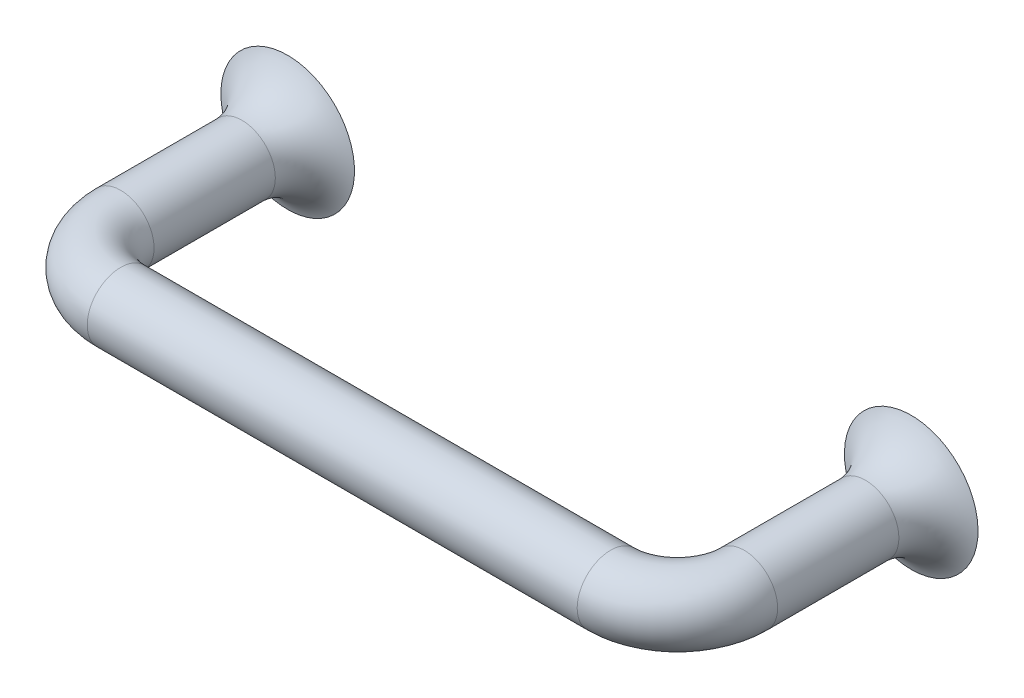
ISO-10303-21;
HEADER;
FILE_DESCRIPTION(('STEP AP214'),'2;1');
FILE_NAME('part.step','',(''),(''),'','','');
FILE_SCHEMA(('AUTOMOTIVE_DESIGN { 1 0 10303 214 1 1 1 1 }'));
ENDSEC;
DATA;
#1=APPLICATION_CONTEXT('core data for automotive mechanical design processes');
#2=APPLICATION_PROTOCOL_DEFINITION('international standard','automotive_design',2000,#1);
#3=PRODUCT_CONTEXT('',#1,'mechanical');
#4=PRODUCT('Part','Part','',(#3));
#5=PRODUCT_RELATED_PRODUCT_CATEGORY('part','',(#4));
#6=PRODUCT_DEFINITION_FORMATION('','',#4);
#7=PRODUCT_DEFINITION_CONTEXT('part definition',#1,'design');
#8=PRODUCT_DEFINITION('design','',#6,#7);
#9=PRODUCT_DEFINITION_SHAPE('','',#8);
#10=(LENGTH_UNIT() NAMED_UNIT(*) SI_UNIT(.MILLI.,.METRE.));
#11=(NAMED_UNIT(*) PLANE_ANGLE_UNIT() SI_UNIT($,.RADIAN.));
#12=(NAMED_UNIT(*) SI_UNIT($,.STERADIAN.) SOLID_ANGLE_UNIT());
#13=UNCERTAINTY_MEASURE_WITH_UNIT(LENGTH_MEASURE(1.E-05),#10,'distance_accuracy_value','');
#14=(GEOMETRIC_REPRESENTATION_CONTEXT(3) GLOBAL_UNCERTAINTY_ASSIGNED_CONTEXT((#13)) GLOBAL_UNIT_ASSIGNED_CONTEXT((#10,
#11,#12)) REPRESENTATION_CONTEXT('',''));
#15=CARTESIAN_POINT('',(0.,0.,0.));
#16=DIRECTION('',(0.,0.,1.));
#17=DIRECTION('',(1.,0.,0.));
#18=AXIS2_PLACEMENT_3D('',#15,#16,#17);
#19=CARTESIAN_POINT('',(0.,0.,37.5000000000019));
#20=DIRECTION('',(0.,0.,-1.));
#21=DIRECTION('',(0.,-1.,0.));
#22=AXIS2_PLACEMENT_3D('',#19,#20,#21);
#23=CYLINDRICAL_SURFACE('',#22,7.5);
#24=CARTESIAN_POINT('',(0.,0.,10.2736435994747));
#25=DIRECTION('',(0.,0.,1.));
#26=DIRECTION('',(1.,0.,0.));
#27=AXIS2_PLACEMENT_3D('',#24,#25,#26);
#28=CIRCLE('',#27,7.5);
#29=CARTESIAN_POINT('',(7.5,0.,10.2736435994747));
#30=VERTEX_POINT('',#29);
#31=EDGE_CURVE('E32',#30,#30,#28,.F.);
#32=ORIENTED_EDGE('',*,*,#31,.F.);
#33=EDGE_LOOP('',(#32));
#34=FACE_BOUND('',#33,.T.);
#35=CARTESIAN_POINT('',(0.,0.,37.5000000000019));
#36=DIRECTION('',(0.,0.,-1.));
#37=DIRECTION('',(0.,1.,0.));
#38=AXIS2_PLACEMENT_3D('',#35,#36,#37);
#39=CIRCLE('',#38,7.5);
#40=CARTESIAN_POINT('',(-7.5,0.,37.5000000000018));
#41=VERTEX_POINT('',#40);
#42=EDGE_CURVE('E35',#41,#41,#39,.T.);
#43=ORIENTED_EDGE('',*,*,#42,.T.);
#44=EDGE_LOOP('',(#43));
#45=FACE_BOUND('',#44,.T.);
#46=ADVANCED_FACE('F12',(#34,#45),#23,.T.);
#47=CARTESIAN_POINT('',(15.,0.,37.5000000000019));
#48=DIRECTION('',(0.,-1.,0.));
#49=DIRECTION('',(1.,0.,0.));
#50=AXIS2_PLACEMENT_3D('',#47,#48,#49);
#51=TOROIDAL_SURFACE('',#50,15.,7.5);
#52=CARTESIAN_POINT('',(15.,0.,52.5000000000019));
#53=DIRECTION('',(-1.,0.,0.));
#54=DIRECTION('',(0.,1.,0.));
#55=AXIS2_PLACEMENT_3D('',#52,#53,#54);
#56=CIRCLE('',#55,7.5);
#57=CARTESIAN_POINT('',(15.,0.,60.0000000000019));
#58=VERTEX_POINT('',#57);
#59=EDGE_CURVE('E43',#58,#58,#56,.T.);
#60=CARTESIAN_POINT('',(15.,0.,37.5000000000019));
#61=DIRECTION('',(0.,-1.,0.));
#62=DIRECTION('',(1.,0.,0.));
#63=AXIS2_PLACEMENT_3D('',#60,#61,#62);
#64=CIRCLE('',#63,22.5);
#65=EDGE_CURVE('',#58,#41,#64,.T.);
#66=ORIENTED_EDGE('',*,*,#59,.T.);
#67=ORIENTED_EDGE('',*,*,#42,.F.);
#68=ORIENTED_EDGE('',*,*,#65,.T.);
#69=ORIENTED_EDGE('',*,*,#65,.F.);
#70=EDGE_LOOP('',(#66,#68,#67,#69));
#71=FACE_BOUND('',#70,.T.);
#72=ADVANCED_FACE('F81',(#71),#51,.T.);
#73=CARTESIAN_POINT('',(125.,0.,52.5000000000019));
#74=DIRECTION('',(-1.,0.,0.));
#75=DIRECTION('',(0.,-1.,0.));
#76=AXIS2_PLACEMENT_3D('',#73,#74,#75);
#77=CYLINDRICAL_SURFACE('',#76,7.5);
#78=CARTESIAN_POINT('',(125.,0.,52.5000000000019));
#79=DIRECTION('',(-1.,0.,0.));
#80=DIRECTION('',(0.,1.,0.));
#81=AXIS2_PLACEMENT_3D('',#78,#79,#80);
#82=CIRCLE('',#81,7.5);
#83=CARTESIAN_POINT('',(125.,0.,60.0000000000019));
#84=VERTEX_POINT('',#83);
#85=EDGE_CURVE('E46',#84,#84,#82,.T.);
#86=ORIENTED_EDGE('',*,*,#85,.T.);
#87=EDGE_LOOP('',(#86));
#88=FACE_BOUND('',#87,.T.);
#89=ORIENTED_EDGE('',*,*,#59,.F.);
#90=EDGE_LOOP('',(#89));
#91=FACE_BOUND('',#90,.T.);
#92=ADVANCED_FACE('F88',(#88,#91),#77,.T.);
#93=CARTESIAN_POINT('',(125.,0.,37.5000000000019));
#94=DIRECTION('',(0.,-1.,0.));
#95=DIRECTION('',(1.,0.,0.));
#96=AXIS2_PLACEMENT_3D('',#93,#94,#95);
#97=TOROIDAL_SURFACE('',#96,15.,7.5);
#98=CARTESIAN_POINT('',(140.,0.,37.5000000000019));
#99=DIRECTION('',(0.,0.,1.));
#100=DIRECTION('',(0.,1.,0.));
#101=AXIS2_PLACEMENT_3D('',#98,#99,#100);
#102=CIRCLE('',#101,7.5);
#103=CARTESIAN_POINT('',(147.5,0.,37.5000000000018));
#104=VERTEX_POINT('',#103);
#105=EDGE_CURVE('E39',#104,#104,#102,.T.);
#106=CARTESIAN_POINT('',(125.,0.,37.5000000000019));
#107=DIRECTION('',(0.,-1.,0.));
#108=DIRECTION('',(1.,0.,0.));
#109=AXIS2_PLACEMENT_3D('',#106,#107,#108);
#110=CIRCLE('',#109,22.5);
#111=EDGE_CURVE('',#104,#84,#110,.T.);
#112=ORIENTED_EDGE('',*,*,#105,.T.);
#113=ORIENTED_EDGE('',*,*,#85,.F.);
#114=ORIENTED_EDGE('',*,*,#111,.T.);
#115=ORIENTED_EDGE('',*,*,#111,.F.);
#116=EDGE_LOOP('',(#112,#114,#113,#115));
#117=FACE_BOUND('',#116,.T.);
#118=ADVANCED_FACE('F131',(#117),#97,.T.);
#119=CARTESIAN_POINT('',(140.,0.,37.5000000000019));
#120=DIRECTION('',(0.,0.,-1.));
#121=DIRECTION('',(0.,-1.,0.));
#122=AXIS2_PLACEMENT_3D('',#119,#120,#121);
#123=CYLINDRICAL_SURFACE('',#122,7.5);
#124=CARTESIAN_POINT('',(140.,0.,10.2736435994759));
#125=DIRECTION('',(0.,0.,1.));
#126=DIRECTION('',(0.,1.,0.));
#127=AXIS2_PLACEMENT_3D('',#124,#125,#126);
#128=CIRCLE('',#127,7.5);
#129=CARTESIAN_POINT('',(140.,7.5,10.2736435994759));
#130=VERTEX_POINT('',#129);
#131=EDGE_CURVE('E36',#130,#130,#128,.T.);
#132=ORIENTED_EDGE('',*,*,#131,.T.);
#133=EDGE_LOOP('',(#132));
#134=FACE_BOUND('',#133,.T.);
#135=ORIENTED_EDGE('',*,*,#105,.F.);
#136=EDGE_LOOP('',(#135));
#137=FACE_BOUND('',#136,.T.);
#138=ADVANCED_FACE('F124',(#134,#137),#123,.T.);
#139=CARTESIAN_POINT('',(140.,0.,11.1368217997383));
#140=DIRECTION('',(0.,0.,-1.));
#141=DIRECTION('',(0.,-1.,0.));
#142=AXIS2_PLACEMENT_3D('',#139,#140,#141);
#143=TOROIDAL_SURFACE('',#142,19.4689148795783,12.);
#144=CARTESIAN_POINT('',(140.,0.,1.93598338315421E-12));
#145=DIRECTION('',(0.,0.,-1.));
#146=DIRECTION('',(0.,-1.,0.));
#147=AXIS2_PLACEMENT_3D('',#144,#145,#146);
#148=CIRCLE('',#147,15.);
#149=CARTESIAN_POINT('',(140.,-15.,1.93598338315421E-12));
#150=VERTEX_POINT('',#149);
#151=EDGE_CURVE('E40',#150,#150,#148,.T.);
#152=ORIENTED_EDGE('',*,*,#151,.F.);
#153=EDGE_LOOP('',(#152));
#154=FACE_BOUND('',#153,.T.);
#155=ORIENTED_EDGE('',*,*,#131,.F.);
#156=EDGE_LOOP('',(#155));
#157=FACE_BOUND('',#156,.T.);
#158=ADVANCED_FACE('F121',(#154,#157),#143,.F.);
#159=CARTESIAN_POINT('',(140.,0.,1.93598338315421E-12));
#160=DIRECTION('',(0.,0.,1.));
#161=DIRECTION('',(0.,1.,0.));
#162=AXIS2_PLACEMENT_3D('',#159,#160,#161);
#163=PLANE('',#162);
#164=CARTESIAN_POINT('',(140.,0.,1.93598338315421E-12));
#165=DIRECTION('',(0.,0.,1.));
#166=DIRECTION('',(1.,0.,0.));
#167=AXIS2_PLACEMENT_3D('',#164,#165,#166);
#168=CIRCLE('',#167,3.45);
#169=CARTESIAN_POINT('',(143.45,0.,1.93598338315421E-12));
#170=VERTEX_POINT('',#169);
#171=EDGE_CURVE('E23',#170,#170,#168,.T.);
#172=ORIENTED_EDGE('',*,*,#171,.T.);
#173=EDGE_LOOP('',(#172));
#174=FACE_BOUND('',#173,.T.);
#175=ORIENTED_EDGE('',*,*,#151,.T.);
#176=EDGE_LOOP('',(#175));
#177=FACE_BOUND('',#176,.T.);
#178=ADVANCED_FACE('F119',(#174,#177),#163,.F.);
#179=CARTESIAN_POINT('',(0.,0.,11.1368217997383));
#180=DIRECTION('',(0.,0.,-1.));
#181=DIRECTION('',(-1.,0.,0.));
#182=AXIS2_PLACEMENT_3D('',#179,#180,#181);
#183=TOROIDAL_SURFACE('',#182,19.4689148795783,12.);
#184=ORIENTED_EDGE('',*,*,#31,.T.);
#185=EDGE_LOOP('',(#184));
#186=FACE_BOUND('',#185,.T.);
#187=CARTESIAN_POINT('',(0.,0.,1.91233057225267E-12));
#188=DIRECTION('',(0.,0.,-1.));
#189=DIRECTION('',(-1.,0.,0.));
#190=AXIS2_PLACEMENT_3D('',#187,#188,#189);
#191=CIRCLE('',#190,15.);
#192=CARTESIAN_POINT('',(-15.,0.,1.9359833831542E-12));
#193=VERTEX_POINT('',#192);
#194=EDGE_CURVE('E53',#193,#193,#191,.T.);
#195=ORIENTED_EDGE('',*,*,#194,.F.);
#196=EDGE_LOOP('',(#195));
#197=FACE_BOUND('',#196,.T.);
#198=ADVANCED_FACE('F114',(#186,#197),#183,.F.);
#199=CARTESIAN_POINT('',(0.,0.,1.94986117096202E-12));
#200=DIRECTION('',(0.,0.,-1.));
#201=DIRECTION('',(0.,1.,0.));
#202=AXIS2_PLACEMENT_3D('',#199,#200,#201);
#203=PLANE('',#202);
#204=CARTESIAN_POINT('',(0.,0.,1.94986117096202E-12));
#205=DIRECTION('',(0.,0.,-1.));
#206=DIRECTION('',(-1.,0.,0.));
#207=AXIS2_PLACEMENT_3D('',#204,#205,#206);
#208=CIRCLE('',#207,3.45);
#209=CARTESIAN_POINT('',(-3.45,0.,1.85376087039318E-12));
#210=VERTEX_POINT('',#209);
#211=EDGE_CURVE('E8',#210,#210,#208,.F.);
#212=ORIENTED_EDGE('',*,*,#211,.T.);
#213=EDGE_LOOP('',(#212));
#214=FACE_BOUND('',#213,.T.);
#215=ORIENTED_EDGE('',*,*,#194,.T.);
#216=EDGE_LOOP('',(#215));
#217=FACE_BOUND('',#216,.T.);
#218=ADVANCED_FACE('F107',(#214,#217),#203,.T.);
#219=CARTESIAN_POINT('',(140.,0.,12.0000000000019));
#220=DIRECTION('',(0.,0.,-1.));
#221=DIRECTION('',(0.,-1.,0.));
#222=AXIS2_PLACEMENT_3D('',#219,#220,#221);
#223=CYLINDRICAL_SURFACE('',#222,3.);
#224=CARTESIAN_POINT('',(140.,0.,0.450000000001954));
#225=DIRECTION('',(0.,0.,1.));
#226=DIRECTION('',(1.,0.,0.));
#227=AXIS2_PLACEMENT_3D('',#224,#225,#226);
#228=CIRCLE('',#227,3.);
#229=CARTESIAN_POINT('',(143.,0.,0.450000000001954));
#230=VERTEX_POINT('',#229);
#231=EDGE_CURVE('E27',#230,#230,#228,.F.);
#232=ORIENTED_EDGE('',*,*,#231,.T.);
#233=EDGE_LOOP('',(#232));
#234=FACE_BOUND('',#233,.T.);
#235=CARTESIAN_POINT('',(140.,0.,12.0000000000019));
#236=DIRECTION('',(0.,0.,-1.));
#237=DIRECTION('',(0.,-1.,0.));
#238=AXIS2_PLACEMENT_3D('',#235,#236,#237);
#239=CIRCLE('',#238,3.);
#240=CARTESIAN_POINT('',(140.,-3.,12.0000000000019));
#241=VERTEX_POINT('',#240);
#242=EDGE_CURVE('E56',#241,#241,#239,.T.);
#243=ORIENTED_EDGE('',*,*,#242,.F.);
#244=EDGE_LOOP('',(#243));
#245=FACE_BOUND('',#244,.T.);
#246=ADVANCED_FACE('F77',(#234,#245),#223,.F.);
#247=CARTESIAN_POINT('',(140.,0.,12.0000000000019));
#248=DIRECTION('',(0.,0.,-1.));
#249=DIRECTION('',(0.,-1.,0.));
#250=AXIS2_PLACEMENT_3D('',#247,#248,#249);
#251=PLANE('',#250);
#252=ORIENTED_EDGE('',*,*,#242,.T.);
#253=EDGE_LOOP('',(#252));
#254=FACE_BOUND('',#253,.T.);
#255=ADVANCED_FACE('F67',(#254),#251,.T.);
#256=CARTESIAN_POINT('',(0.,0.,12.0000000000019));
#257=DIRECTION('',(0.,0.,-1.));
#258=DIRECTION('',(0.,-1.,0.));
#259=AXIS2_PLACEMENT_3D('',#256,#257,#258);
#260=CYLINDRICAL_SURFACE('',#259,3.);
#261=CARTESIAN_POINT('',(0.,0.,0.450000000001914));
#262=DIRECTION('',(0.,0.,-1.));
#263=DIRECTION('',(-1.,0.,0.));
#264=AXIS2_PLACEMENT_3D('',#261,#262,#263);
#265=CIRCLE('',#264,3.);
#266=CARTESIAN_POINT('',(-3.,0.,0.450000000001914));
#267=VERTEX_POINT('',#266);
#268=EDGE_CURVE('E19',#267,#267,#265,.T.);
#269=ORIENTED_EDGE('',*,*,#268,.T.);
#270=EDGE_LOOP('',(#269));
#271=FACE_BOUND('',#270,.T.);
#272=CARTESIAN_POINT('',(0.,0.,12.0000000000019));
#273=DIRECTION('',(0.,0.,-1.));
#274=DIRECTION('',(0.,-1.,0.));
#275=AXIS2_PLACEMENT_3D('',#272,#273,#274);
#276=CIRCLE('',#275,3.);
#277=CARTESIAN_POINT('',(0.,-3.,12.0000000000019));
#278=VERTEX_POINT('',#277);
#279=EDGE_CURVE('E59',#278,#278,#276,.T.);
#280=ORIENTED_EDGE('',*,*,#279,.F.);
#281=EDGE_LOOP('',(#280));
#282=FACE_BOUND('',#281,.T.);
#283=ADVANCED_FACE('F65',(#271,#282),#260,.F.);
#284=CARTESIAN_POINT('',(0.,0.,12.0000000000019));
#285=DIRECTION('',(0.,0.,-1.));
#286=DIRECTION('',(0.,-1.,0.));
#287=AXIS2_PLACEMENT_3D('',#284,#285,#286);
#288=PLANE('',#287);
#289=ORIENTED_EDGE('',*,*,#279,.T.);
#290=EDGE_LOOP('',(#289));
#291=FACE_BOUND('',#290,.T.);
#292=ADVANCED_FACE('F63',(#291),#288,.T.);
#293=CARTESIAN_POINT('',(140.,0.,0.450000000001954));
#294=DIRECTION('',(0.,0.,-1.));
#295=DIRECTION('',(-1.,0.,0.));
#296=AXIS2_PLACEMENT_3D('',#293,#294,#295);
#297=CONICAL_SURFACE('',#296,3.,0.785398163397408);
#298=ORIENTED_EDGE('',*,*,#171,.F.);
#299=EDGE_LOOP('',(#298));
#300=FACE_BOUND('',#299,.T.);
#301=ORIENTED_EDGE('',*,*,#231,.F.);
#302=EDGE_LOOP('',(#301));
#303=FACE_BOUND('',#302,.T.);
#304=ADVANCED_FACE('F75',(#300,#303),#297,.F.);
#305=CARTESIAN_POINT('',(0.,0.,0.450000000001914));
#306=DIRECTION('',(0.,0.,-1.));
#307=DIRECTION('',(-1.,0.,0.));
#308=AXIS2_PLACEMENT_3D('',#305,#306,#307);
#309=CONICAL_SURFACE('',#308,3.,0.785398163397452);
#310=ORIENTED_EDGE('',*,*,#211,.F.);
#311=EDGE_LOOP('',(#310));
#312=FACE_BOUND('',#311,.T.);
#313=ORIENTED_EDGE('',*,*,#268,.F.);
#314=EDGE_LOOP('',(#313));
#315=FACE_BOUND('',#314,.T.);
#316=ADVANCED_FACE('F14',(#312,#315),#309,.F.);
#317=CLOSED_SHELL('',(#46,#72,#92,#118,#138,#158,#178,#198,#218,#246,#255,#283,#292,#304,#316));
#318=MANIFOLD_SOLID_BREP('B1',#317);
#319=ADVANCED_BREP_SHAPE_REPRESENTATION('',(#18,#318),#14);
#320=SHAPE_DEFINITION_REPRESENTATION(#9,#319);
ENDSEC;
END-ISO-10303-21;
